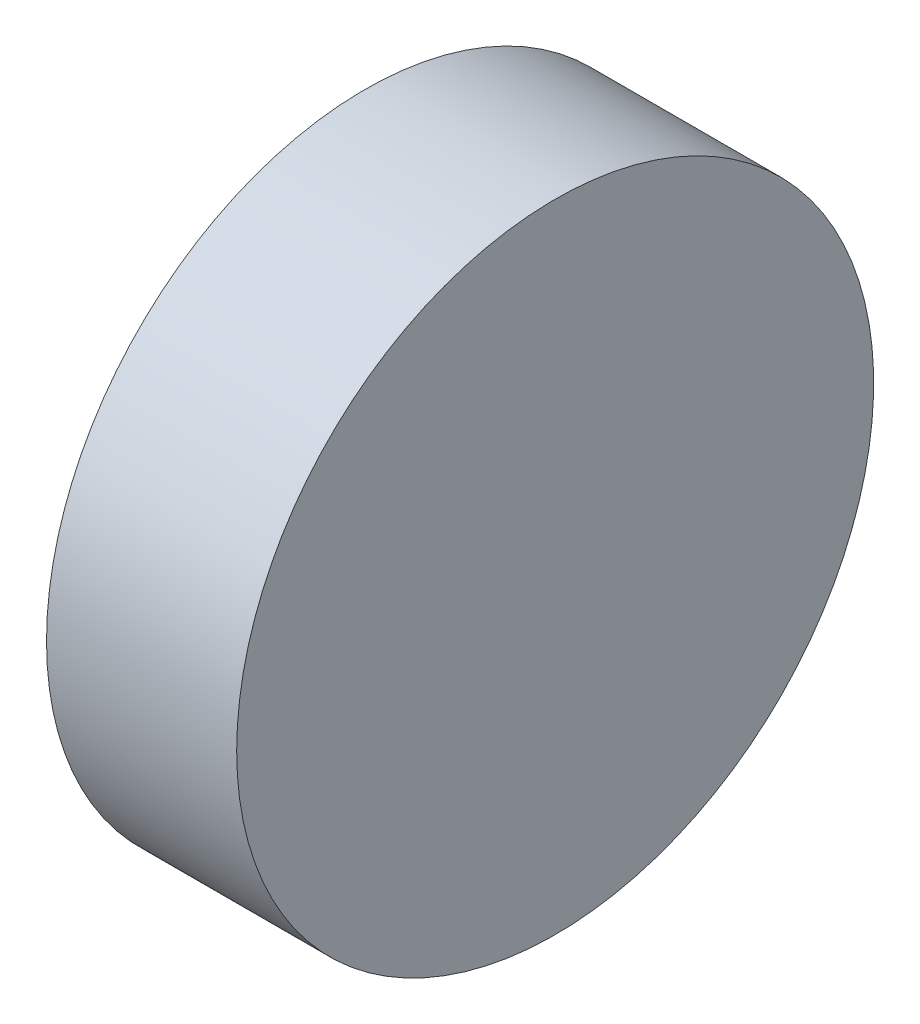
ISO-10303-21;
HEADER;
FILE_DESCRIPTION(('STEP AP214'),'2;1');
FILE_NAME('part.step','',(''),(''),'','','');
FILE_SCHEMA(('AUTOMOTIVE_DESIGN { 1 0 10303 214 1 1 1 1 }'));
ENDSEC;
DATA;
#1=APPLICATION_CONTEXT('core data for automotive mechanical design processes');
#2=APPLICATION_PROTOCOL_DEFINITION('international standard','automotive_design',2000,#1);
#3=PRODUCT_CONTEXT('',#1,'mechanical');
#4=PRODUCT('Part','Part','',(#3));
#5=PRODUCT_RELATED_PRODUCT_CATEGORY('part','',(#4));
#6=PRODUCT_DEFINITION_FORMATION('','',#4);
#7=PRODUCT_DEFINITION_CONTEXT('part definition',#1,'design');
#8=PRODUCT_DEFINITION('design','',#6,#7);
#9=PRODUCT_DEFINITION_SHAPE('','',#8);
#10=(LENGTH_UNIT() NAMED_UNIT(*) SI_UNIT(.MILLI.,.METRE.));
#11=(NAMED_UNIT(*) PLANE_ANGLE_UNIT() SI_UNIT($,.RADIAN.));
#12=(NAMED_UNIT(*) SI_UNIT($,.STERADIAN.) SOLID_ANGLE_UNIT());
#13=UNCERTAINTY_MEASURE_WITH_UNIT(LENGTH_MEASURE(1.E-05),#10,'distance_accuracy_value','');
#14=(GEOMETRIC_REPRESENTATION_CONTEXT(3) GLOBAL_UNCERTAINTY_ASSIGNED_CONTEXT((#13)) GLOBAL_UNIT_ASSIGNED_CONTEXT((#10,
#11,#12)) REPRESENTATION_CONTEXT('',''));
#15=CARTESIAN_POINT('',(0.,0.,0.));
#16=DIRECTION('',(0.,0.,1.));
#17=DIRECTION('',(1.,0.,0.));
#18=AXIS2_PLACEMENT_3D('',#15,#16,#17);
#19=CARTESIAN_POINT('',(0.,0.,0.));
#20=DIRECTION('',(1.,0.,0.));
#21=DIRECTION('',(0.,0.,-0.999999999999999));
#22=AXIS2_PLACEMENT_3D('',#19,#20,#21);
#23=PLANE('',#22);
#24=DIRECTION('',(0.,-0.499999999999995,-0.86602540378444));
#25=VECTOR('',#24,1.);
#26=CARTESIAN_POINT('',(0.,-1.20650000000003,2.08971929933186));
#27=LINE('',#26,#25);
#28=CARTESIAN_POINT('',(0.,-2.41300000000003,0.));
#29=VERTEX_POINT('',#28);
#30=CARTESIAN_POINT('',(0.,-1.20650000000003,2.08971929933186));
#31=VERTEX_POINT('',#30);
#32=EDGE_CURVE('E76',#29,#31,#27,.F.);
#33=ORIENTED_EDGE('',*,*,#32,.T.);
#34=DIRECTION('',(0.,0.999999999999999,0.));
#35=VECTOR('',#34,1.);
#36=CARTESIAN_POINT('',(0.,1.20649999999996,2.08971929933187));
#37=LINE('',#36,#35);
#38=CARTESIAN_POINT('',(0.,1.20649999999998,2.08971929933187));
#39=VERTEX_POINT('',#38);
#40=EDGE_CURVE('E92',#31,#39,#37,.T.);
#41=ORIENTED_EDGE('',*,*,#40,.T.);
#42=DIRECTION('',(0.,-0.499999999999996,0.86602540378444));
#43=VECTOR('',#42,1.);
#44=CARTESIAN_POINT('',(0.,2.41299999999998,0.));
#45=LINE('',#44,#43);
#46=CARTESIAN_POINT('',(0.,2.41299999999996,0.));
#47=VERTEX_POINT('',#46);
#48=EDGE_CURVE('E97',#39,#47,#45,.F.);
#49=ORIENTED_EDGE('',*,*,#48,.T.);
#50=DIRECTION('',(0.,0.499999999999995,0.86602540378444));
#51=VECTOR('',#50,1.);
#52=CARTESIAN_POINT('',(0.,1.20649999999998,-2.08971929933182));
#53=LINE('',#52,#51);
#54=CARTESIAN_POINT('',(0.,1.20649999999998,-2.08971929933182));
#55=VERTEX_POINT('',#54);
#56=EDGE_CURVE('E102',#47,#55,#53,.F.);
#57=ORIENTED_EDGE('',*,*,#56,.T.);
#58=DIRECTION('',(0.,0.999999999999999,0.));
#59=VECTOR('',#58,1.);
#60=CARTESIAN_POINT('',(0.,-1.20650000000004,-2.08971929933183));
#61=LINE('',#60,#59);
#62=CARTESIAN_POINT('',(0.,-1.20650000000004,-2.08971929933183));
#63=VERTEX_POINT('',#62);
#64=EDGE_CURVE('E61',#55,#63,#61,.F.);
#65=ORIENTED_EDGE('',*,*,#64,.T.);
#66=DIRECTION('',(0.,0.499999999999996,-0.86602540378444));
#67=VECTOR('',#66,1.);
#68=CARTESIAN_POINT('',(0.,-2.41300000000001,0.));
#69=LINE('',#68,#67);
#70=EDGE_CURVE('E73',#63,#29,#69,.F.);
#71=ORIENTED_EDGE('',*,*,#70,.T.);
#72=EDGE_LOOP('',(#33,#41,#49,#57,#65,#71));
#73=FACE_BOUND('',#72,.T.);
#74=ADVANCED_FACE('F17',(#73),#23,.F.);
#75=CARTESIAN_POINT('',(0.,-2.41300000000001,0.));
#76=DIRECTION('',(0.,-0.86602540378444,-0.499999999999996));
#77=DIRECTION('',(0.,0.499999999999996,-0.86602540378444));
#78=AXIS2_PLACEMENT_3D('',#75,#76,#77);
#79=PLANE('',#78);
#80=DIRECTION('',(1.,0.,0.));
#81=VECTOR('',#80,1.);
#82=CARTESIAN_POINT('',(0.,-2.41300000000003,0.));
#83=LINE('',#82,#81);
#84=CARTESIAN_POINT('',(-1.27,-2.41300000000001,0.));
#85=VERTEX_POINT('',#84);
#86=EDGE_CURVE('E78',#85,#29,#83,.T.);
#87=ORIENTED_EDGE('',*,*,#86,.T.);
#88=ORIENTED_EDGE('',*,*,#70,.F.);
#89=DIRECTION('',(-1.,0.,0.));
#90=VECTOR('',#89,1.);
#91=CARTESIAN_POINT('',(0.,-1.20650000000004,-2.08971929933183));
#92=LINE('',#91,#90);
#93=CARTESIAN_POINT('',(-1.27,-1.20650000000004,-2.08971929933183));
#94=VERTEX_POINT('',#93);
#95=EDGE_CURVE('E54',#63,#94,#92,.T.);
#96=ORIENTED_EDGE('',*,*,#95,.T.);
#97=DIRECTION('',(0.,-0.499999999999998,0.866025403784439));
#98=VECTOR('',#97,1.);
#99=CARTESIAN_POINT('',(-1.27,-1.20650000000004,-2.08971929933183));
#100=LINE('',#99,#98);
#101=EDGE_CURVE('E83',#94,#85,#100,.T.);
#102=ORIENTED_EDGE('',*,*,#101,.T.);
#103=EDGE_LOOP('',(#87,#88,#96,#102));
#104=FACE_BOUND('',#103,.T.);
#105=ADVANCED_FACE('F81',(#104),#79,.F.);
#106=CARTESIAN_POINT('',(0.,-1.20650000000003,2.08971929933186));
#107=DIRECTION('',(0.,-0.86602540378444,0.499999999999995));
#108=DIRECTION('',(0.,-0.499999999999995,-0.86602540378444));
#109=AXIS2_PLACEMENT_3D('',#106,#107,#108);
#110=PLANE('',#109);
#111=DIRECTION('',(1.,0.,0.));
#112=VECTOR('',#111,1.);
#113=CARTESIAN_POINT('',(0.,-1.20650000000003,2.08971929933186));
#114=LINE('',#113,#112);
#115=CARTESIAN_POINT('',(-1.27,-1.20650000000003,2.08971929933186));
#116=VERTEX_POINT('',#115);
#117=EDGE_CURVE('E89',#116,#31,#114,.T.);
#118=ORIENTED_EDGE('',*,*,#117,.T.);
#119=ORIENTED_EDGE('',*,*,#32,.F.);
#120=ORIENTED_EDGE('',*,*,#86,.F.);
#121=DIRECTION('',(0.,0.499999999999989,0.866025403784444));
#122=VECTOR('',#121,1.);
#123=CARTESIAN_POINT('',(-1.27,-2.41300000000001,0.));
#124=LINE('',#123,#122);
#125=EDGE_CURVE('E117',#85,#116,#124,.T.);
#126=ORIENTED_EDGE('',*,*,#125,.T.);
#127=EDGE_LOOP('',(#118,#119,#120,#126));
#128=FACE_BOUND('',#127,.T.);
#129=ADVANCED_FACE('F87',(#128),#110,.F.);
#130=CARTESIAN_POINT('',(0.,1.20649999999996,2.08971929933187));
#131=DIRECTION('',(0.,0.,0.999999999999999));
#132=DIRECTION('',(1.,0.,0.));
#133=AXIS2_PLACEMENT_3D('',#130,#131,#132);
#134=PLANE('',#133);
#135=DIRECTION('',(1.,0.,0.));
#136=VECTOR('',#135,1.);
#137=CARTESIAN_POINT('',(0.,1.20649999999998,2.08971929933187));
#138=LINE('',#137,#136);
#139=CARTESIAN_POINT('',(-1.27,1.20649999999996,2.08971929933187));
#140=VERTEX_POINT('',#139);
#141=EDGE_CURVE('E95',#140,#39,#138,.T.);
#142=ORIENTED_EDGE('',*,*,#141,.T.);
#143=ORIENTED_EDGE('',*,*,#40,.F.);
#144=ORIENTED_EDGE('',*,*,#117,.F.);
#145=DIRECTION('',(0.,0.999999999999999,0.));
#146=VECTOR('',#145,1.);
#147=CARTESIAN_POINT('',(-1.27,-0.386772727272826,2.08971929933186));
#148=LINE('',#147,#146);
#149=EDGE_CURVE('E115',#116,#140,#148,.T.);
#150=ORIENTED_EDGE('',*,*,#149,.T.);
#151=EDGE_LOOP('',(#142,#143,#144,#150));
#152=FACE_BOUND('',#151,.T.);
#153=ADVANCED_FACE('F122',(#152),#134,.F.);
#154=CARTESIAN_POINT('',(0.,2.41299999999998,0.));
#155=DIRECTION('',(0.,0.86602540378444,0.499999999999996));
#156=DIRECTION('',(0.,-0.499999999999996,0.86602540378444));
#157=AXIS2_PLACEMENT_3D('',#154,#155,#156);
#158=PLANE('',#157);
#159=DIRECTION('',(1.,0.,0.));
#160=VECTOR('',#159,1.);
#161=CARTESIAN_POINT('',(0.,2.41299999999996,0.));
#162=LINE('',#161,#160);
#163=CARTESIAN_POINT('',(-1.27,2.41299999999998,0.));
#164=VERTEX_POINT('',#163);
#165=EDGE_CURVE('E99',#164,#47,#162,.T.);
#166=ORIENTED_EDGE('',*,*,#165,.T.);
#167=ORIENTED_EDGE('',*,*,#48,.F.);
#168=ORIENTED_EDGE('',*,*,#141,.F.);
#169=DIRECTION('',(0.,0.499999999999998,-0.866025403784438));
#170=VECTOR('',#169,1.);
#171=CARTESIAN_POINT('',(-1.27,1.20649999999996,2.08971929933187));
#172=LINE('',#171,#170);
#173=EDGE_CURVE('E113',#140,#164,#172,.T.);
#174=ORIENTED_EDGE('',*,*,#173,.T.);
#175=EDGE_LOOP('',(#166,#167,#168,#174));
#176=FACE_BOUND('',#175,.T.);
#177=ADVANCED_FACE('F129',(#176),#158,.F.);
#178=CARTESIAN_POINT('',(0.,1.20649999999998,-2.08971929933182));
#179=DIRECTION('',(0.,0.86602540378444,-0.499999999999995));
#180=DIRECTION('',(0.,0.499999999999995,0.86602540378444));
#181=AXIS2_PLACEMENT_3D('',#178,#179,#180);
#182=PLANE('',#181);
#183=DIRECTION('',(-1.,0.,0.));
#184=VECTOR('',#183,1.);
#185=CARTESIAN_POINT('',(0.,1.20649999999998,-2.08971929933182));
#186=LINE('',#185,#184);
#187=CARTESIAN_POINT('',(-1.27,1.20649999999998,-2.08971929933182));
#188=VERTEX_POINT('',#187);
#189=EDGE_CURVE('E104',#188,#55,#186,.F.);
#190=ORIENTED_EDGE('',*,*,#189,.T.);
#191=ORIENTED_EDGE('',*,*,#56,.F.);
#192=ORIENTED_EDGE('',*,*,#165,.F.);
#193=DIRECTION('',(0.,-0.500000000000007,-0.866025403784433));
#194=VECTOR('',#193,1.);
#195=CARTESIAN_POINT('',(-1.27,2.41299999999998,0.));
#196=LINE('',#195,#194);
#197=EDGE_CURVE('E34',#164,#188,#196,.T.);
#198=ORIENTED_EDGE('',*,*,#197,.T.);
#199=EDGE_LOOP('',(#190,#191,#192,#198));
#200=FACE_BOUND('',#199,.T.);
#201=ADVANCED_FACE('F132',(#200),#182,.F.);
#202=CARTESIAN_POINT('',(0.,-1.20650000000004,-2.08971929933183));
#203=DIRECTION('',(0.,0.,-0.999999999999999));
#204=DIRECTION('',(-1.,0.,0.));
#205=AXIS2_PLACEMENT_3D('',#202,#203,#204);
#206=PLANE('',#205);
#207=ORIENTED_EDGE('',*,*,#95,.F.);
#208=ORIENTED_EDGE('',*,*,#64,.F.);
#209=ORIENTED_EDGE('',*,*,#189,.F.);
#210=DIRECTION('',(0.,0.999999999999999,0.));
#211=VECTOR('',#210,1.);
#212=CARTESIAN_POINT('',(-1.27,-0.386772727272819,-2.08971929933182));
#213=LINE('',#212,#211);
#214=EDGE_CURVE('E110',#188,#94,#213,.F.);
#215=ORIENTED_EDGE('',*,*,#214,.T.);
#216=EDGE_LOOP('',(#207,#208,#209,#215));
#217=FACE_BOUND('',#216,.T.);
#218=ADVANCED_FACE('F134',(#217),#206,.F.);
#219=CARTESIAN_POINT('',(1.27,-0.386772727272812,0.));
#220=DIRECTION('',(1.,0.,0.));
#221=DIRECTION('',(0.,0.,-0.999999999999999));
#222=AXIS2_PLACEMENT_3D('',#219,#220,#221);
#223=PLANE('',#222);
#224=CARTESIAN_POINT('',(1.27,0.,0.));
#225=DIRECTION('',(-1.,0.,0.));
#226=DIRECTION('',(0.,0.,0.999999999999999));
#227=AXIS2_PLACEMENT_3D('',#224,#225,#226);
#228=CIRCLE('',#227,4.2545);
#229=CARTESIAN_POINT('',(1.27,0.,4.25449999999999));
#230=VERTEX_POINT('',#229);
#231=EDGE_CURVE('E21',#230,#230,#228,.T.);
#232=ORIENTED_EDGE('',*,*,#231,.F.);
#233=EDGE_LOOP('',(#232));
#234=FACE_BOUND('',#233,.T.);
#235=ADVANCED_FACE('F136',(#234),#223,.T.);
#236=CARTESIAN_POINT('',(-1.27,-0.386772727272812,0.));
#237=DIRECTION('',(1.,0.,0.));
#238=DIRECTION('',(0.,0.,-0.999999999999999));
#239=AXIS2_PLACEMENT_3D('',#236,#237,#238);
#240=PLANE('',#239);
#241=ORIENTED_EDGE('',*,*,#197,.F.);
#242=ORIENTED_EDGE('',*,*,#173,.F.);
#243=ORIENTED_EDGE('',*,*,#149,.F.);
#244=ORIENTED_EDGE('',*,*,#125,.F.);
#245=ORIENTED_EDGE('',*,*,#101,.F.);
#246=ORIENTED_EDGE('',*,*,#214,.F.);
#247=EDGE_LOOP('',(#241,#242,#243,#244,#245,#246));
#248=FACE_BOUND('',#247,.T.);
#249=CARTESIAN_POINT('',(-1.27,0.,0.));
#250=DIRECTION('',(-1.,0.,0.));
#251=DIRECTION('',(0.,0.,0.999999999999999));
#252=AXIS2_PLACEMENT_3D('',#249,#250,#251);
#253=CIRCLE('',#252,4.2545);
#254=CARTESIAN_POINT('',(-1.27,0.,4.25449999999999));
#255=VERTEX_POINT('',#254);
#256=EDGE_CURVE('E11',#255,#255,#253,.F.);
#257=ORIENTED_EDGE('',*,*,#256,.F.);
#258=EDGE_LOOP('',(#257));
#259=FACE_BOUND('',#258,.T.);
#260=ADVANCED_FACE('F125',(#248,#259),#240,.F.);
#261=CARTESIAN_POINT('',(1.27,0.,0.));
#262=DIRECTION('',(-1.,0.,0.));
#263=DIRECTION('',(0.,0.,0.999999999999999));
#264=AXIS2_PLACEMENT_3D('',#261,#262,#263);
#265=CYLINDRICAL_SURFACE('',#264,4.2545);
#266=ORIENTED_EDGE('',*,*,#231,.T.);
#267=EDGE_LOOP('',(#266));
#268=FACE_BOUND('',#267,.T.);
#269=ORIENTED_EDGE('',*,*,#256,.T.);
#270=EDGE_LOOP('',(#269));
#271=FACE_BOUND('',#270,.T.);
#272=ADVANCED_FACE('F19',(#268,#271),#265,.T.);
#273=CLOSED_SHELL('',(#74,#105,#129,#153,#177,#201,#218,#235,#260,#272));
#274=MANIFOLD_SOLID_BREP('B1',#273);
#275=ADVANCED_BREP_SHAPE_REPRESENTATION('',(#18,#274),#14);
#276=SHAPE_DEFINITION_REPRESENTATION(#9,#275);
ENDSEC;
END-ISO-10303-21;
